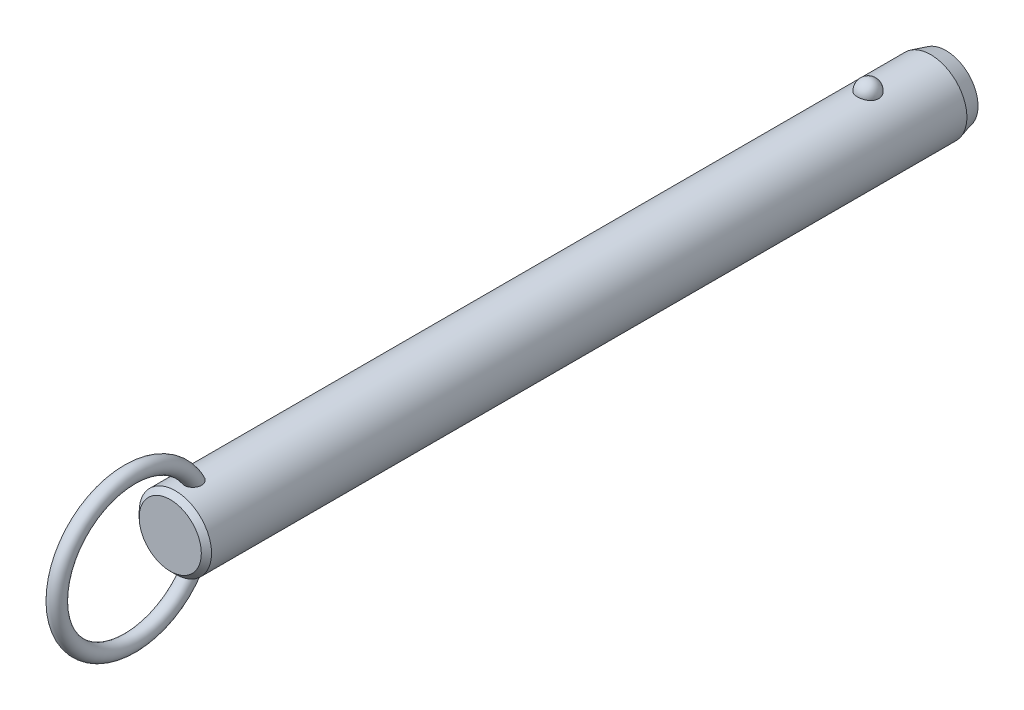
ISO-10303-21;
HEADER;
FILE_DESCRIPTION(('STEP AP214'),'2;1');
FILE_NAME('part.step','',(''),(''),'','','');
FILE_SCHEMA(('AUTOMOTIVE_DESIGN { 1 0 10303 214 1 1 1 1 }'));
ENDSEC;
DATA;
#1=APPLICATION_CONTEXT('core data for automotive mechanical design processes');
#2=APPLICATION_PROTOCOL_DEFINITION('international standard','automotive_design',2000,#1);
#3=PRODUCT_CONTEXT('',#1,'mechanical');
#4=PRODUCT('Part','Part','',(#3));
#5=PRODUCT_RELATED_PRODUCT_CATEGORY('part','',(#4));
#6=PRODUCT_DEFINITION_FORMATION('','',#4);
#7=PRODUCT_DEFINITION_CONTEXT('part definition',#1,'design');
#8=PRODUCT_DEFINITION('design','',#6,#7);
#9=PRODUCT_DEFINITION_SHAPE('','',#8);
#10=(LENGTH_UNIT() NAMED_UNIT(*) SI_UNIT(.MILLI.,.METRE.));
#11=(NAMED_UNIT(*) PLANE_ANGLE_UNIT() SI_UNIT($,.RADIAN.));
#12=(NAMED_UNIT(*) SI_UNIT($,.STERADIAN.) SOLID_ANGLE_UNIT());
#13=UNCERTAINTY_MEASURE_WITH_UNIT(LENGTH_MEASURE(1.E-05),#10,'distance_accuracy_value','');
#14=(GEOMETRIC_REPRESENTATION_CONTEXT(3) GLOBAL_UNCERTAINTY_ASSIGNED_CONTEXT((#13)) GLOBAL_UNIT_ASSIGNED_CONTEXT((#10,
#11,#12)) REPRESENTATION_CONTEXT('',''));
#15=CARTESIAN_POINT('',(0.,0.,0.));
#16=DIRECTION('',(0.,0.,1.));
#17=DIRECTION('',(1.,0.,0.));
#18=AXIS2_PLACEMENT_3D('',#15,#16,#17);
#19=CARTESIAN_POINT('',(0.,0.,127.));
#20=DIRECTION('',(0.,0.,-1.));
#21=DIRECTION('',(-1.,0.,0.));
#22=AXIS2_PLACEMENT_3D('',#19,#20,#21);
#23=CYLINDRICAL_SURFACE('',#22,7.1);
#24=CARTESIAN_POINT('',(2.0769088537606,6.78943661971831,-2.1));
#25=CARTESIAN_POINT('',(2.07690739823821,6.78943796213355,-1.98268154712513));
#26=CARTESIAN_POINT('',(2.06738130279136,6.79237331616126,-1.86534506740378));
#27=CARTESIAN_POINT('',(2.0295040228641,6.8037853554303,-1.63400788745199));
#28=CARTESIAN_POINT('',(2.00114757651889,6.81226358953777,-1.52000812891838));
#29=CARTESIAN_POINT('',(1.92632025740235,6.83379798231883,-1.29863433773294));
#30=CARTESIAN_POINT('',(1.87985726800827,6.84685214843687,-1.19125744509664));
#31=CARTESIAN_POINT('',(1.76995205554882,6.87608091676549,-0.98604657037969));
#32=CARTESIAN_POINT('',(1.70650980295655,6.8922555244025,-0.88821260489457));
#33=CARTESIAN_POINT('',(1.5638119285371,6.92602930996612,-0.704242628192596));
#34=CARTESIAN_POINT('',(1.4844714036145,6.94363582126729,-0.618173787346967));
#35=CARTESIAN_POINT('',(1.31221746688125,6.97823658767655,-0.460740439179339));
#36=CARTESIAN_POINT('',(1.21930409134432,6.99523084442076,-0.389375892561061));
#37=CARTESIAN_POINT('',(1.02268781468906,7.02666176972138,-0.263547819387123));
#38=CARTESIAN_POINT('',(0.91902009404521,7.04110638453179,-0.209031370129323));
#39=CARTESIAN_POINT('',(0.703548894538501,7.06588726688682,-0.118163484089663));
#40=CARTESIAN_POINT('',(0.591746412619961,7.07622403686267,-0.0818098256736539));
#41=CARTESIAN_POINT('',(0.365557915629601,7.09147068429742,-0.0288711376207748));
#42=CARTESIAN_POINT('',(0.251267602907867,7.09648447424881,-0.0119070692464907));
#43=CARTESIAN_POINT('',(0.0213499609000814,7.10089837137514,0.00304925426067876));
#44=CARTESIAN_POINT('',(-0.0942772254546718,7.10029907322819,0.00104351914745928));
#45=CARTESIAN_POINT('',(-0.321651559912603,7.09360829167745,-0.0216931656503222));
#46=CARTESIAN_POINT('',(-0.433431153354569,7.08760388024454,-0.0421272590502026));
#47=CARTESIAN_POINT('',(-0.651862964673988,7.07086131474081,-0.100729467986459));
#48=CARTESIAN_POINT('',(-0.758515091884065,7.06012307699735,-0.138897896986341));
#49=CARTESIAN_POINT('',(-0.964449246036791,7.03496097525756,-0.232213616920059));
#50=CARTESIAN_POINT('',(-1.06368095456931,7.02051445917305,-0.287465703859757));
#51=CARTESIAN_POINT('',(-1.25145353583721,6.98948740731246,-0.413383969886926));
#52=CARTESIAN_POINT('',(-1.33999321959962,6.97290663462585,-0.48405186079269));
#53=CARTESIAN_POINT('',(-1.50591604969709,6.93898770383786,-0.640594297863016));
#54=CARTESIAN_POINT('',(-1.58302488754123,6.92164094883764,-0.726757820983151));
#55=CARTESIAN_POINT('',(-1.72189320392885,6.8884103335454,-0.91092752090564));
#56=CARTESIAN_POINT('',(-1.78365144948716,6.87252659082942,-1.008934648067));
#57=CARTESIAN_POINT('',(-1.89101272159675,6.84377189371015,-1.21549497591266));
#58=CARTESIAN_POINT('',(-1.93639553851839,6.83094274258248,-1.32416860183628));
#59=CARTESIAN_POINT('',(-2.00874275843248,6.81002070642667,-1.54791500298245));
#60=CARTESIAN_POINT('',(-2.03570774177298,6.80192767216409,-1.66298757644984));
#61=CARTESIAN_POINT('',(-2.07047276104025,6.7914266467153,-1.89571453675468));
#62=CARTESIAN_POINT('',(-2.07835878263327,6.78899315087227,-2.01335491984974));
#63=CARTESIAN_POINT('',(-2.07502083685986,6.79001409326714,-2.24833570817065));
#64=CARTESIAN_POINT('',(-2.06379746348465,6.7934683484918,-2.36567612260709));
#65=CARTESIAN_POINT('',(-2.02263913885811,6.80583442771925,-2.59603194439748));
#66=CARTESIAN_POINT('',(-1.99281127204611,6.81471501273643,-2.70906820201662));
#67=CARTESIAN_POINT('',(-1.91526639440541,6.83691232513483,-2.92836575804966));
#68=CARTESIAN_POINT('',(-1.8675486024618,6.85022924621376,-3.03462676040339));
#69=CARTESIAN_POINT('',(-1.75504492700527,6.87991336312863,-3.23806487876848));
#70=CARTESIAN_POINT('',(-1.69015924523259,6.89629822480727,-3.33518422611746));
#71=CARTESIAN_POINT('',(-1.54505404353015,6.93024852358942,-3.51697105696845));
#72=CARTESIAN_POINT('',(-1.46483385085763,6.94781401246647,-3.60163799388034));
#73=CARTESIAN_POINT('',(-1.29071406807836,6.98225977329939,-3.75654119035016));
#74=CARTESIAN_POINT('',(-1.19675650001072,6.99913673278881,-3.82671308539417));
#75=CARTESIAN_POINT('',(-0.997940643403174,7.03023618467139,-3.9501837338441));
#76=CARTESIAN_POINT('',(-0.89308318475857,7.04445887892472,-4.00348377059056));
#77=CARTESIAN_POINT('',(-0.676902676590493,7.06848365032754,-4.09107242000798));
#78=CARTESIAN_POINT('',(-0.565686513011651,7.0783430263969,-4.12560889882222));
#79=CARTESIAN_POINT('',(-0.338739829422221,7.09282534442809,-4.17575450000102));
#80=CARTESIAN_POINT('',(-0.223009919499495,7.09744899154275,-4.19136617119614));
#81=CARTESIAN_POINT('',(0.00707628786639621,7.10090930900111,-4.20307965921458));
#82=CARTESIAN_POINT('',(0.121410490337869,7.09986531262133,-4.19958377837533));
#83=CARTESIAN_POINT('',(0.347815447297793,7.092380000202,-4.17411564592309));
#84=CARTESIAN_POINT('',(0.459886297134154,7.08593891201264,-4.15214417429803));
#85=CARTESIAN_POINT('',(0.678084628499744,7.06838983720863,-4.09049562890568));
#86=CARTESIAN_POINT('',(0.784237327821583,7.05730369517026,-4.05090137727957));
#87=CARTESIAN_POINT('',(0.988305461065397,7.03163139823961,-3.95511447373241));
#88=CARTESIAN_POINT('',(1.08622031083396,7.01704499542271,-3.89892064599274));
#89=CARTESIAN_POINT('',(1.27284490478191,6.98562668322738,-3.77035541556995));
#90=CARTESIAN_POINT('',(1.36137372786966,6.96876135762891,-3.69772964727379));
#91=CARTESIAN_POINT('',(1.52509486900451,6.93477412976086,-3.53878279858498));
#92=CARTESIAN_POINT('',(1.60028496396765,6.91765218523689,-3.45245943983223));
#93=CARTESIAN_POINT('',(1.73681688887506,6.88465753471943,-3.26658774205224));
#94=CARTESIAN_POINT('',(1.79785966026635,6.86881574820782,-3.16681408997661));
#95=CARTESIAN_POINT('',(1.90265327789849,6.84053157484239,-2.95814408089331));
#96=CARTESIAN_POINT('',(1.94640861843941,6.82808830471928,-2.84925010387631));
#97=CARTESIAN_POINT('',(2.01274378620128,6.80881460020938,-2.63454318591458));
#98=CARTESIAN_POINT('',(2.03676193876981,6.80160856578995,-2.52920574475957));
#99=CARTESIAN_POINT('',(2.06884490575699,6.79191902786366,-2.3159172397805));
#100=CARTESIAN_POINT('',(2.07691019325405,6.78943538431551,-2.20796625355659));
#101=CARTESIAN_POINT('',(2.0769088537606,6.78943661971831,-2.1));
#102=B_SPLINE_CURVE_WITH_KNOTS('',3,(#24,#25,#26,#27,#28,#29,#30,#31,#32,#33,#34,#35,#36,#37,
#38,#39,#40,#41,#42,#43,#44,#45,#46,#47,#48,#49,#50,#51,#52,#53,#54,#55,#56,#57,#58,#59,#60,#61,
#62,#63,#64,#65,#66,#67,#68,#69,#70,#71,#72,#73,#74,#75,#76,#77,#78,#79,#80,#81,#82,#83,#84,#85,
#86,#87,#88,#89,#90,#91,#92,#93,#94,#95,#96,#97,#98,#99,#100,#101),.UNSPECIFIED.,.T.,.F.,(4,2,2,
2,2,2,2,2,2,2,2,2,2,2,2,2,2,2,2,2,2,2,2,2,2,2,2,2,2,2,2,2,2,2,2,2,2,2,4),(0.,0.351568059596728,
0.703234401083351,1.05474780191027,1.40626181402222,1.75970563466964,2.11314851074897,
2.4654696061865,2.81774759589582,3.16301449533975,3.50824481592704,3.84801136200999,
4.18778391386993,4.52968352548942,4.87162112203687,5.22076181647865,5.56993054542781,
5.92363364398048,6.27732559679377,6.62942052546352,6.98150450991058,7.33158042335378,
7.68167162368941,8.03384443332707,8.38603269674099,8.73975272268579,9.09344583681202,
9.44234545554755,9.79119807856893,10.1327344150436,10.4742563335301,10.8141898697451,
11.1541474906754,11.4997793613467,11.8454687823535,12.1979079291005,12.5502553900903,
12.8738073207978,13.1973496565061),.UNSPECIFIED.);
#103=CARTESIAN_POINT('',(2.0769088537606,6.78943661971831,-2.1));
#104=VERTEX_POINT('',#103);
#105=EDGE_CURVE('E41',#104,#104,#102,.T.);
#106=ORIENTED_EDGE('',*,*,#105,.T.);
#107=EDGE_LOOP('',(#106));
#108=FACE_BOUND('',#107,.T.);
#109=CARTESIAN_POINT('',(0.,0.,133.92));
#110=DIRECTION('',(0.,0.,1.));
#111=DIRECTION('',(1.,0.,0.));
#112=AXIS2_PLACEMENT_3D('',#109,#110,#111);
#113=CIRCLE('',#112,7.1);
#114=CARTESIAN_POINT('',(7.1,0.,133.92));
#115=VERTEX_POINT('',#114);
#116=EDGE_CURVE('E10',#115,#115,#113,.F.);
#117=ORIENTED_EDGE('',*,*,#116,.T.);
#118=EDGE_LOOP('',(#117));
#119=FACE_BOUND('',#118,.T.);
#120=CARTESIAN_POINT('',(-0.429539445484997,-7.08699541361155,128.742921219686));
#121=CARTESIAN_POINT('',(-0.508331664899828,-7.08221999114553,128.766876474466));
#122=CARTESIAN_POINT('',(-0.585039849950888,-7.07624016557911,128.797457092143));
#123=CARTESIAN_POINT('',(-0.73208265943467,-7.06254296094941,128.871024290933));
#124=CARTESIAN_POINT('',(-0.802417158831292,-7.05482554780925,128.914011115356));
#125=CARTESIAN_POINT('',(-0.934722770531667,-7.03851844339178,129.011113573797));
#126=CARTESIAN_POINT('',(-0.996700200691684,-7.02992941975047,129.065220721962));
#127=CARTESIAN_POINT('',(-1.11079942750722,-7.01280697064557,129.182967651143));
#128=CARTESIAN_POINT('',(-1.16292136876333,-7.00427354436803,129.246607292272));
#129=CARTESIAN_POINT('',(-1.25705660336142,-6.98799959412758,129.382687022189));
#130=CARTESIAN_POINT('',(-1.29888032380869,-6.98027525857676,129.455259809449));
#131=CARTESIAN_POINT('',(-1.37069920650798,-6.96652886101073,129.606168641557));
#132=CARTESIAN_POINT('',(-1.40069157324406,-6.96050720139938,129.684506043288));
#133=CARTESIAN_POINT('',(-1.45043507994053,-6.95031881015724,129.850190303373));
#134=CARTESIAN_POINT('',(-1.46937115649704,-6.94630231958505,129.937789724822));
#135=CARTESIAN_POINT('',(-1.49424917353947,-6.94099239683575,130.114871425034));
#136=CARTESIAN_POINT('',(-1.50018601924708,-6.93970003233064,130.204354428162));
#137=CARTESIAN_POINT('',(-1.49978214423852,-6.93978815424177,130.394060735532));
#138=CARTESIAN_POINT('',(-1.49187639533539,-6.94150934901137,130.494279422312));
#139=CARTESIAN_POINT('',(-1.46177925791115,-6.94790814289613,130.692479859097));
#140=CARTESIAN_POINT('',(-1.43957541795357,-6.95258831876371,130.790459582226));
#141=CARTESIAN_POINT('',(-1.37783293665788,-6.96510647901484,130.99536292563));
#142=CARTESIAN_POINT('',(-1.33634073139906,-6.97328848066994,131.101680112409));
#143=CARTESIAN_POINT('',(-1.23686994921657,-6.99161706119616,131.306177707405));
#144=CARTESIAN_POINT('',(-1.17889192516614,-7.00176357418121,131.404358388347));
#145=CARTESIAN_POINT('',(-1.05875124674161,-7.02082898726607,131.572374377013));
#146=CARTESIAN_POINT('',(-0.999247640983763,-7.02963746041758,131.644123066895));
#147=CARTESIAN_POINT('',(-0.869494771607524,-7.04686074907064,131.777195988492));
#148=CARTESIAN_POINT('',(-0.799263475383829,-7.05527619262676,131.838537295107));
#149=CARTESIAN_POINT('',(-0.665408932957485,-7.06899457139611,131.935131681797));
#150=CARTESIAN_POINT('',(-0.603817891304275,-7.07457275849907,131.973151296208));
#151=CARTESIAN_POINT('',(-0.475172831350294,-7.08437420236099,132.038758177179));
#152=CARTESIAN_POINT('',(-0.4081230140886,-7.08859848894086,132.066353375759));
#153=CARTESIAN_POINT('',(-0.26943193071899,-7.09522749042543,132.109256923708));
#154=CARTESIAN_POINT('',(-0.197757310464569,-7.09761688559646,132.124461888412));
#155=CARTESIAN_POINT('',(-0.05278498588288,-7.10017268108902,132.140716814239));
#156=CARTESIAN_POINT('',(0.020511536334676,-7.10034065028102,132.141776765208));
#157=CARTESIAN_POINT('',(0.156426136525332,-7.09855986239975,132.130461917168));
#158=CARTESIAN_POINT('',(0.219199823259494,-7.09688191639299,132.119806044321));
#159=CARTESIAN_POINT('',(0.342134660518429,-7.09201880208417,132.088537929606));
#160=CARTESIAN_POINT('',(0.402295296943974,-7.08883333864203,132.067923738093));
#161=CARTESIAN_POINT('',(0.520687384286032,-7.08113868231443,132.017212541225));
#162=CARTESIAN_POINT('',(0.578791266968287,-7.07658958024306,131.986827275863));
#163=CARTESIAN_POINT('',(0.69017323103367,-7.06659708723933,131.918367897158));
#164=CARTESIAN_POINT('',(0.743447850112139,-7.061153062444,131.880288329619));
#165=CARTESIAN_POINT('',(0.87094790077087,-7.04680292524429,131.776592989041));
#166=CARTESIAN_POINT('',(0.941828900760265,-7.03755800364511,131.706897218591));
#167=CARTESIAN_POINT('',(1.07136606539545,-7.01900793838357,131.556945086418));
#168=CARTESIAN_POINT('',(1.13000013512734,-7.00970271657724,131.476670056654));
#169=CARTESIAN_POINT('',(1.23579584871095,-6.99183327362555,131.306899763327));
#170=CARTESIAN_POINT('',(1.28274271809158,-6.98328455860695,131.217269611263));
#171=CARTESIAN_POINT('',(1.3635144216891,-6.96796352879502,131.032176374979));
#172=CARTESIAN_POINT('',(1.39733971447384,-6.96119115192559,130.936713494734));
#173=CARTESIAN_POINT('',(1.45579181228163,-6.94922464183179,130.72530928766));
#174=CARTESIAN_POINT('',(1.47790145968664,-6.94449000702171,130.608631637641));
#175=CARTESIAN_POINT('',(1.50168752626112,-6.93938731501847,130.373015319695));
#176=CARTESIAN_POINT('',(1.50336085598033,-6.93901991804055,130.25407631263));
#177=CARTESIAN_POINT('',(1.48486516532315,-6.9430010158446,130.02360799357));
#178=CARTESIAN_POINT('',(1.46573441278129,-6.9471253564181,129.911995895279));
#179=CARTESIAN_POINT('',(1.40606892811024,-6.95944667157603,129.694886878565));
#180=CARTESIAN_POINT('',(1.36556446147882,-6.96763788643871,129.5893815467));
#181=CARTESIAN_POINT('',(1.2708270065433,-6.98548038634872,129.404287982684));
#182=CARTESIAN_POINT('',(1.21949810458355,-6.99473841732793,129.323171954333));
#183=CARTESIAN_POINT('',(1.10242050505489,-7.0141406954,129.172227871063));
#184=CARTESIAN_POINT('',(1.03668119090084,-7.02428436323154,129.10239252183));
#185=CARTESIAN_POINT('',(0.900559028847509,-7.04295285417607,128.983573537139));
#186=CARTESIAN_POINT('',(0.831428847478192,-7.05153466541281,128.933157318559));
#187=CARTESIAN_POINT('',(0.685291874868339,-7.06723150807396,128.845142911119));
#188=CARTESIAN_POINT('',(0.608287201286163,-7.07434693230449,128.807541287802));
#189=CARTESIAN_POINT('',(0.451878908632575,-7.08602232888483,128.747491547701));
#190=CARTESIAN_POINT('',(0.372686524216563,-7.09067127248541,128.724508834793));
#191=CARTESIAN_POINT('',(0.211477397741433,-7.09730788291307,128.692035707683));
#192=CARTESIAN_POINT('',(0.12946098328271,-7.09929585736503,128.68254373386));
#193=CARTESIAN_POINT('',(-0.0332905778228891,-7.10037858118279,128.677351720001));
#194=CARTESIAN_POINT('',(-0.114016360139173,-7.09953334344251,128.681365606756));
#195=CARTESIAN_POINT('',(-0.27367033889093,-7.09517338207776,128.702454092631));
#196=CARTESIAN_POINT('',(-0.352598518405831,-7.09165863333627,128.719528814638));
#197=CARTESIAN_POINT('',(-0.429539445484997,-7.08699541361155,128.742921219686));
#198=B_SPLINE_CURVE_WITH_KNOTS('',3,(#120,#121,#122,#123,#124,#125,#126,#127,#128,#129,#130,
#131,#132,#133,#134,#135,#136,#137,#138,#139,#140,#141,#142,#143,#144,#145,#146,#147,#148,#149,
#150,#151,#152,#153,#154,#155,#156,#157,#158,#159,#160,#161,#162,#163,#164,#165,#166,#167,#168,
#169,#170,#171,#172,#173,#174,#175,#176,#177,#178,#179,#180,#181,#182,#183,#184,#185,#186,#187,
#188,#189,#190,#191,#192,#193,#194,#195,#196,#197),.UNSPECIFIED.,.T.,.F.,(4,2,2,2,2,2,2,2,2,2,2,
2,2,2,2,2,2,2,2,2,2,2,2,2,2,2,2,2,2,2,2,2,2,2,2,2,2,2,4),(0.,0.247183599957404,
0.494372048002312,0.741372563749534,0.988369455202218,1.23962059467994,1.490931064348,
1.75897818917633,2.02713035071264,2.3275826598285,2.62829697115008,2.97008736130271,
3.31186629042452,3.59175319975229,3.87117637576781,4.08813841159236,4.30493502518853,
4.5235225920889,4.74195577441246,4.93215328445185,5.12238804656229,5.318848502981,
5.51544871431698,5.81332317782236,6.11173048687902,6.41527266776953,6.71880423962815,
7.07358156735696,7.42841252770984,7.76631485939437,8.10373999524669,8.39142246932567,
8.67891817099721,8.93560332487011,9.19221962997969,9.43881106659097,9.68537399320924,
9.92674752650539,10.1681233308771),.UNSPECIFIED.);
#199=CARTESIAN_POINT('',(-0.429539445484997,-7.08699541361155,128.742921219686));
#200=VERTEX_POINT('',#199);
#201=EDGE_CURVE('E59',#200,#200,#198,.T.);
#202=ORIENTED_EDGE('',*,*,#201,.T.);
#203=EDGE_LOOP('',(#202));
#204=FACE_BOUND('',#203,.T.);
#205=CARTESIAN_POINT('',(-0.429539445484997,7.08699541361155,128.742921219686));
#206=CARTESIAN_POINT('',(-0.351665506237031,7.09171429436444,128.719246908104));
#207=CARTESIAN_POINT('',(-0.271733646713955,7.09525896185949,128.702036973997));
#208=CARTESIAN_POINT('',(-0.110026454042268,7.09960839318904,128.681005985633));
#209=CARTESIAN_POINT('',(-0.0282502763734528,7.10041187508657,128.677191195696));
#210=CARTESIAN_POINT('',(0.134782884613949,7.09918849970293,128.683059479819));
#211=CARTESIAN_POINT('',(0.216039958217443,7.09716214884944,128.69274013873));
#212=CARTESIAN_POINT('',(0.375730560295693,7.09050177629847,128.725347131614));
#213=CARTESIAN_POINT('',(0.454164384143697,7.08586802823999,128.748272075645));
#214=CARTESIAN_POINT('',(0.606025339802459,7.07449911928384,128.806771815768));
#215=CARTESIAN_POINT('',(0.679451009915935,7.06776334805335,128.842350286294));
#216=CARTESIAN_POINT('',(0.81923414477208,7.05292866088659,128.925175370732));
#217=CARTESIAN_POINT('',(0.885591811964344,7.04482978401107,128.972421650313));
#218=CARTESIAN_POINT('',(1.00993211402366,7.02808709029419,129.077590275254));
#219=CARTESIAN_POINT('',(1.06785399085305,7.01943990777,129.135583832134));
#220=CARTESIAN_POINT('',(1.17342527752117,7.00256662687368,129.260301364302));
#221=CARTESIAN_POINT('',(1.22107408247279,6.99434055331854,129.327025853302));
#222=CARTESIAN_POINT('',(1.30652927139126,6.97889183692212,129.469362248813));
#223=CARTESIAN_POINT('',(1.34399711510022,6.97170674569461,129.545180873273));
#224=CARTESIAN_POINT('',(1.40682616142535,6.95930080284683,129.701810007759));
#225=CARTESIAN_POINT('',(1.43218374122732,6.95408053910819,129.78262200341));
#226=CARTESIAN_POINT('',(1.47246409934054,6.94566853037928,129.953531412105));
#227=CARTESIAN_POINT('',(1.48642590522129,6.9426653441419,130.04386307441));
#228=CARTESIAN_POINT('',(1.5011410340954,6.93949744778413,130.225619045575));
#229=CARTESIAN_POINT('',(1.50188917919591,6.93933385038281,130.317043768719));
#230=CARTESIAN_POINT('',(1.49030464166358,6.94183245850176,130.51084381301));
#231=CARTESIAN_POINT('',(1.47627413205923,6.94486147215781,130.613112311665));
#232=CARTESIAN_POINT('',(1.43356351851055,6.95380194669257,130.814471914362));
#233=CARTESIAN_POINT('',(1.4048676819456,6.95971650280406,130.913559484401));
#234=CARTESIAN_POINT('',(1.32908750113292,6.97461208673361,131.118908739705));
#235=CARTESIAN_POINT('',(1.28011435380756,6.98388945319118,131.224456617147));
#236=CARTESIAN_POINT('',(1.16520357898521,7.00397743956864,131.425760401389));
#237=CARTESIAN_POINT('',(1.09927694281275,7.01478706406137,131.521522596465));
#238=CARTESIAN_POINT('',(0.969361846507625,7.03373936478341,131.676756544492));
#239=CARTESIAN_POINT('',(0.909042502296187,7.04187023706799,131.739303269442));
#240=CARTESIAN_POINT('',(0.779178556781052,7.05741732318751,131.854053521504));
#241=CARTESIAN_POINT('',(0.709649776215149,7.06483472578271,131.906274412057));
#242=CARTESIAN_POINT('',(0.576854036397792,7.0767751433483,131.988113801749));
#243=CARTESIAN_POINT('',(0.515118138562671,7.08158033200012,132.020164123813));
#244=CARTESIAN_POINT('',(0.387127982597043,7.08972701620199,132.073765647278));
#245=CARTESIAN_POINT('',(0.320877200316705,7.09306962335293,132.095324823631));
#246=CARTESIAN_POINT('',(0.185041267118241,7.09791507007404,132.126400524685));
#247=CARTESIAN_POINT('',(0.115437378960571,7.09940591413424,132.135838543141));
#248=CARTESIAN_POINT('',(-0.024315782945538,7.10030171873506,132.141522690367));
#249=CARTESIAN_POINT('',(-0.0944648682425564,7.0997073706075,132.137773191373));
#250=CARTESIAN_POINT('',(-0.225713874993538,7.09668414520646,132.118508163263));
#251=CARTESIAN_POINT('',(-0.287006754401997,7.09444865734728,132.104232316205));
#252=CARTESIAN_POINT('',(-0.406555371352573,7.08860360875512,132.066368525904));
#253=CARTESIAN_POINT('',(-0.464809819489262,7.08499346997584,132.042776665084));
#254=CARTESIAN_POINT('',(-0.594955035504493,7.07541654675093,131.978923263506));
#255=CARTESIAN_POINT('',(-0.665389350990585,7.06906574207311,131.935753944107));
#256=CARTESIAN_POINT('',(-0.798242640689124,7.05530261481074,131.838587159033));
#257=CARTESIAN_POINT('',(-0.860645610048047,7.0478882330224,131.784568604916));
#258=CARTESIAN_POINT('',(-0.994249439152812,7.03045217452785,131.650996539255));
#259=CARTESIAN_POINT('',(-1.06260129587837,7.02030745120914,131.568614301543));
#260=CARTESIAN_POINT('',(-1.18502045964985,7.00068382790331,131.393843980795));
#261=CARTESIAN_POINT('',(-1.23907684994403,6.99120544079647,131.301448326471));
#262=CARTESIAN_POINT('',(-1.33335589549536,6.97384343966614,131.108008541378));
#263=CARTESIAN_POINT('',(-1.37336138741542,6.96598557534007,131.006856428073));
#264=CARTESIAN_POINT('',(-1.43770677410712,6.95299053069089,130.799504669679));
#265=CARTESIAN_POINT('',(-1.46204473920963,6.94785368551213,130.69330440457));
#266=CARTESIAN_POINT('',(-1.49537533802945,6.94076296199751,130.468231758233));
#267=CARTESIAN_POINT('',(-1.50273564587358,6.93914842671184,130.34909751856));
#268=CARTESIAN_POINT('',(-1.4954555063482,6.94072368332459,130.111470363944));
#269=CARTESIAN_POINT('',(-1.48082914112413,6.94391040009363,129.992977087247));
#270=CARTESIAN_POINT('',(-1.43076401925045,6.95438579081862,129.773432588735));
#271=CARTESIAN_POINT('',(-1.39762227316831,6.96121852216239,129.671841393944));
#272=CARTESIAN_POINT('',(-1.31211274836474,6.97783941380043,129.477351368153));
#273=CARTESIAN_POINT('',(-1.25976607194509,6.98762432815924,129.38444313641));
#274=CARTESIAN_POINT('',(-1.14583073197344,7.00713153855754,129.224160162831));
#275=CARTESIAN_POINT('',(-1.08665947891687,7.01665982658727,129.155035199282));
#276=CARTESIAN_POINT('',(-0.956606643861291,7.03556646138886,129.028878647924));
#277=CARTESIAN_POINT('',(-0.885737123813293,7.04494495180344,128.971834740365));
#278=CARTESIAN_POINT('',(-0.7515580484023,7.06035735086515,128.883100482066));
#279=CARTESIAN_POINT('',(-0.690120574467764,7.0666695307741,128.848593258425));
#280=CARTESIAN_POINT('',(-0.562815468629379,7.07794609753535,128.788750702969));
#281=CARTESIAN_POINT('',(-0.496948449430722,7.08291067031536,128.763414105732));
#282=CARTESIAN_POINT('',(-0.429539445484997,7.08699541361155,128.742921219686));
#283=B_SPLINE_CURVE_WITH_KNOTS('',3,(#205,#206,#207,#208,#209,#210,#211,#212,#213,#214,#215,
#216,#217,#218,#219,#220,#221,#222,#223,#224,#225,#226,#227,#228,#229,#230,#231,#232,#233,#234,
#235,#236,#237,#238,#239,#240,#241,#242,#243,#244,#245,#246,#247,#248,#249,#250,#251,#252,#253,
#254,#255,#256,#257,#258,#259,#260,#261,#262,#263,#264,#265,#266,#267,#268,#269,#270,#271,#272,
#273,#274,#275,#276,#277,#278,#279,#280,#281,#282),.UNSPECIFIED.,.T.,.F.,(4,2,2,2,2,2,2,2,2,2,2,
2,2,2,2,2,2,2,2,2,2,2,2,2,2,2,2,2,2,2,2,2,2,2,2,2,2,2,4),(0.,0.244335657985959,
0.488785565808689,0.733191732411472,0.977572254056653,1.22202379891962,1.46646834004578,
1.71259457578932,1.9587352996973,2.21226768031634,2.46587585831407,2.73913816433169,
3.01250754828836,3.32109936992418,3.63002293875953,3.9786351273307,4.32702187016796,
4.58793945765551,4.84841449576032,5.05676704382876,5.26496096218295,5.47449661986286,
5.68396281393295,5.87205447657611,6.06022532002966,6.30743751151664,6.55513496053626,
6.87602468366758,7.19715875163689,7.5230577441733,7.84899686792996,8.20516155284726,
8.56109821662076,8.88040084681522,9.19935367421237,9.47236282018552,9.74509220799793,
9.95662250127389,10.1681235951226),.UNSPECIFIED.);
#284=CARTESIAN_POINT('',(-0.429539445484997,7.08699541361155,128.742921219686));
#285=VERTEX_POINT('',#284);
#286=EDGE_CURVE('E67',#285,#285,#283,.T.);
#287=ORIENTED_EDGE('',*,*,#286,.T.);
#288=EDGE_LOOP('',(#287));
#289=FACE_BOUND('',#288,.T.);
#290=CARTESIAN_POINT('',(0.,0.,-14.3999999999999));
#291=DIRECTION('',(0.,0.,-1.));
#292=DIRECTION('',(-1.,0.,0.));
#293=AXIS2_PLACEMENT_3D('',#290,#291,#292);
#294=CIRCLE('',#293,7.1);
#295=CARTESIAN_POINT('',(-7.1,0.,-14.3999999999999));
#296=VERTEX_POINT('',#295);
#297=EDGE_CURVE('E56',#296,#296,#294,.F.);
#298=ORIENTED_EDGE('',*,*,#297,.T.);
#299=EDGE_LOOP('',(#298));
#300=FACE_BOUND('',#299,.T.);
#301=ADVANCED_FACE('F37',(#108,#119,#204,#289,#300),#23,.T.);
#302=CARTESIAN_POINT('',(0.,0.,-17.4));
#303=DIRECTION('',(0.,0.,-1.));
#304=DIRECTION('',(-1.,0.,0.));
#305=AXIS2_PLACEMENT_3D('',#302,#303,#304);
#306=PLANE('',#305);
#307=CARTESIAN_POINT('',(0.,0.,-17.4));
#308=DIRECTION('',(0.,0.,-1.));
#309=DIRECTION('',(-1.,0.,0.));
#310=AXIS2_PLACEMENT_3D('',#307,#308,#309);
#311=CIRCLE('',#310,6.29615242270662);
#312=CARTESIAN_POINT('',(-6.29615242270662,0.,-17.4));
#313=VERTEX_POINT('',#312);
#314=EDGE_CURVE('E66',#313,#313,#311,.T.);
#315=ORIENTED_EDGE('',*,*,#314,.T.);
#316=EDGE_LOOP('',(#315));
#317=FACE_BOUND('',#316,.T.);
#318=ADVANCED_FACE('F85',(#317),#306,.T.);
#319=CARTESIAN_POINT('',(0.,0.,-17.4));
#320=DIRECTION('',(0.,0.,1.));
#321=DIRECTION('',(1.,0.,0.));
#322=AXIS2_PLACEMENT_3D('',#319,#320,#321);
#323=CONICAL_SURFACE('',#322,6.29615242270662,0.261799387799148);
#324=ORIENTED_EDGE('',*,*,#297,.F.);
#325=EDGE_LOOP('',(#324));
#326=FACE_BOUND('',#325,.T.);
#327=ORIENTED_EDGE('',*,*,#314,.F.);
#328=EDGE_LOOP('',(#327));
#329=FACE_BOUND('',#328,.T.);
#330=ADVANCED_FACE('F83',(#326,#329),#323,.T.);
#331=CARTESIAN_POINT('',(0.,0.,134.92));
#332=DIRECTION('',(0.,0.,1.));
#333=DIRECTION('',(1.,0.,0.));
#334=AXIS2_PLACEMENT_3D('',#331,#332,#333);
#335=PLANE('',#334);
#336=CARTESIAN_POINT('',(0.,0.,134.92));
#337=DIRECTION('',(0.,0.,1.));
#338=DIRECTION('',(1.,0.,0.));
#339=AXIS2_PLACEMENT_3D('',#336,#337,#338);
#340=CIRCLE('',#339,6.10000000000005);
#341=CARTESIAN_POINT('',(6.10000000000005,0.,134.92));
#342=VERTEX_POINT('',#341);
#343=EDGE_CURVE('E50',#342,#342,#340,.T.);
#344=ORIENTED_EDGE('',*,*,#343,.T.);
#345=EDGE_LOOP('',(#344));
#346=FACE_BOUND('',#345,.T.);
#347=ADVANCED_FACE('F77',(#346),#335,.T.);
#348=CARTESIAN_POINT('',(0.,0.,142.85));
#349=DIRECTION('',(1.,0.,0.));
#350=DIRECTION('',(0.,0.,-1.));
#351=AXIS2_PLACEMENT_3D('',#348,#349,#350);
#352=TOROIDAL_SURFACE('',#351,14.35,1.5);
#353=ORIENTED_EDGE('',*,*,#286,.F.);
#354=EDGE_LOOP('',(#353));
#355=FACE_BOUND('',#354,.T.);
#356=ORIENTED_EDGE('',*,*,#201,.F.);
#357=EDGE_LOOP('',(#356));
#358=FACE_BOUND('',#357,.T.);
#359=ADVANCED_FACE('F73',(#355,#358),#352,.T.);
#360=CARTESIAN_POINT('',(0.,0.,134.92));
#361=DIRECTION('',(0.,0.,-1.));
#362=DIRECTION('',(-1.,0.,0.));
#363=AXIS2_PLACEMENT_3D('',#360,#361,#362);
#364=CONICAL_SURFACE('',#363,6.10000000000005,0.78539816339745);
#365=ORIENTED_EDGE('',*,*,#116,.F.);
#366=EDGE_LOOP('',(#365));
#367=FACE_BOUND('',#366,.T.);
#368=ORIENTED_EDGE('',*,*,#343,.F.);
#369=EDGE_LOOP('',(#368));
#370=FACE_BOUND('',#369,.T.);
#371=ADVANCED_FACE('F39',(#367,#370),#364,.T.);
#372=CARTESIAN_POINT('',(0.,7.1,-2.1));
#373=DIRECTION('',(0.,1.,0.));
#374=DIRECTION('',(0.,0.,1.));
#375=AXIS2_PLACEMENT_3D('',#372,#373,#374);
#376=SPHERICAL_SURFACE('',#375,2.10000000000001);
#377=ORIENTED_EDGE('',*,*,#105,.F.);
#378=EDGE_LOOP('',(#377));
#379=FACE_BOUND('',#378,.T.);
#380=ADVANCED_FACE('F79',(#379),#376,.T.);
#381=CLOSED_SHELL('',(#301,#318,#330,#347,#359,#371,#380));
#382=MANIFOLD_SOLID_BREP('B2',#381);
#383=ADVANCED_BREP_SHAPE_REPRESENTATION('',(#18,#382),#14);
#384=SHAPE_DEFINITION_REPRESENTATION(#9,#383);
ENDSEC;
END-ISO-10303-21;
